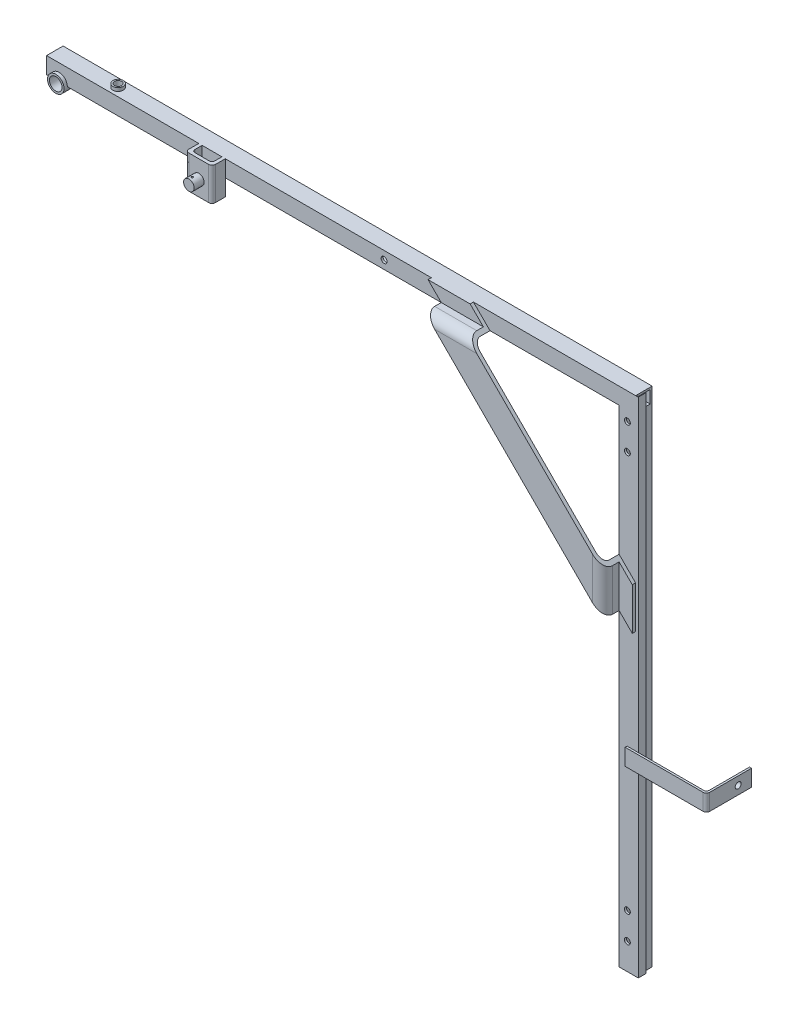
from build123d import *

# Parameters (mm, degrees)
ESQUISSE2_W              = 25
ESQUISSE2_H              = 25
ESQUISSE2_W_2            = 19
ESQUISSE2_H_2            = 19
ESQUISSE3_W              = 25
ESQUISSE3_H              = 25
ESQUISSE3_W_2            = 19
ESQUISSE3_H_2            = 19
EXTRUSION1_DEPTH         = 735
ESQUISSE4_R              = 12.5
ENL_V_MAT_EXTRU_2_DEPTH  = 1163.532257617
EXTRUSION2_DEPTH         = 5
EXTRUSION2_DEPTH_BACK    = 30
ESQUISSE5_R              = 12.5
ESQUISSE5_R_2            = 9.5
ESQUISSE7_R              = 4.5
ENL_V_MAT_EXTRU_4_DEPTH  = 1163.650527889
EXTRUSION3_DEPTH         = 30
ENL_V_MAT_EXTRU_5_DEPTH  = 25
CONG_1_R                 = 10
CONG_2_R                 = 10
ENL_V_MAT_EXTRU_6_DEPTH  = 415
ENL_V_MAT_EXTRU_7_DEPTH  = 1164.04019707
EXTRUSION5_DEPTH         = 50
ESQUISSE14_R             = 8
ENL_V_MAT_EXTRU_8_DEPTH  = 5
EXTRUSION6_DEPTH         = 15
EXTRUSION6_DEPTH_BACK    = 7
ESQUISSE15_R             = 8
ESQUISSE16_R             = 1.5
ENL_V_MAT_EXTRU_9_DEPTH  = 1172.305361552
ESQUISSE17_W             = 122.83893509
ESQUISSE17_H             = 25
EXTRUSION7_DEPTH         = 3
ESQUISSE18_W             = 3
ESQUISSE18_H             = 25
EXTRUSION8_DEPTH         = 65
CONG_3_R                 = 4
CONG_4_R                 = 5
ESQUISSE19_R             = 7.5
ENL_V_MAT_EXTRU_10_DEPTH = 65
EXTRUSION9_DEPTH         = 5
EXTRUSION9_DEPTH_BACK    = 3
ESQUISSE23_R             = 7.5
ESQUISSE23_R_2           = 4.5
EXTRUSION11_DEPTH        = 760
ESQUISSE26_R             = 7.802651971
EXTRUSION12_DEPTH        = 5
ESQUISSE27_R             = 5.5
ENL_V_MAT_EXTRU_11_DEPTH = 1175.768594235


with BuildPart() as part:
    # Balayage2: sweep along a path in Esquisse1
    with BuildLine(Plane.XY) as balayage2_path:
        Line((-890, 0), (0, 0))
    # Esquisse2 → Balayage2 (sweep)
    with BuildSketch(Plane(origin=(-890, 0, 0), x_dir=(0, 0, -1), z_dir=(1, 0, 0))):
        Rectangle(ESQUISSE2_W, ESQUISSE2_H)
        Rectangle(ESQUISSE2_W_2, ESQUISSE2_H_2, mode=Mode.SUBTRACT)
    sweep(path=balayage2_path.line)

    # Esquisse3 → Extrusion1 (add)
    with BuildSketch(Plane.XZ.offset(12.5)):
        with Locations((-12.5, 0)):
            Rectangle(ESQUISSE3_W, ESQUISSE3_H)
        with Locations((-12.5, 0)):
            Rectangle(ESQUISSE3_W_2, ESQUISSE3_H_2, mode=Mode.SUBTRACT)
    extrude(amount=EXTRUSION1_DEPTH)

    # Esquisse4 → Enl_v. mat.-Extru.2 (cut, through all)
    with BuildSketch(Plane.XY.offset(12.5)):
        with Locations((-871.107379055, -12.5)):
            Circle(ESQUISSE4_R)
    extrude(amount=-ENL_V_MAT_EXTRU_2_DEPTH, mode=Mode.SUBTRACT)

    # Esquisse5 → Extrusion2 (add, two sides: drawn at the far end of the back side and taken through both)
    with BuildSketch(Plane.XY.offset(12.5).offset(-EXTRUSION2_DEPTH_BACK)):
        with Locations((-871.107379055, -12.5)):
            Circle(ESQUISSE5_R)
        with Locations((-871.107379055, -12.5)):
            Circle(ESQUISSE5_R_2, mode=Mode.SUBTRACT)
    extrude(amount=EXTRUSION2_DEPTH + EXTRUSION2_DEPTH_BACK)

    # Esquisse7 → Enl_v. mat.-Extru.4 (cut, through all)
    with BuildSketch(Plane.XY.offset(12.5)):
        with Locations((-12.5, -27.5)):
            Circle(ESQUISSE7_R)
        with Locations((-12.5, -67.5)):
            Circle(ESQUISSE7_R)
        with Locations((-12.5, -707.5)):
            Circle(ESQUISSE7_R)
        with Locations((-12.5, -667.5)):
            Circle(ESQUISSE7_R)
        with Locations((-380, 0)):
            Circle(ESQUISSE7_R)
    extrude(amount=-ENL_V_MAT_EXTRU_4_DEPTH, mode=Mode.SUBTRACT)

    # Esquisse8 → Extrusion3 (add)
    with BuildSketch(Plane.XY.offset(12.5)):
        Polygon((-308.639610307, 12.5), (0, -296.139610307), (0, -232.5), (-245, 12.5), align=None)
    extrude(amount=EXTRUSION3_DEPTH)

    # Esquisse9 → Enl_v. mat.-Extru.5 (cut)
    with BuildSketch(Plane(origin=(0, 0, 12.5), x_dir=(-1, 0, 0), z_dir=(0, 0, -1))):
        Polygon((25, -271.139610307), (25, -207.5), (220, -12.5), (283.639610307, -12.5), align=None)
    extrude(amount=-ENL_V_MAT_EXTRU_5_DEPTH, mode=Mode.SUBTRACT)

    # Cong_1
    cong_1_edges = [part.edges().sort_by_distance(p)[0] for p in [
        (-251.819805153, -12.5, 37.5),
    ]]
    fillet(cong_1_edges, radius=CONG_1_R)

    # Cong_2
    cong_2_edges = [part.edges().sort_by_distance(p)[0] for p in [
        (-25, -239.319805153, 37.5),
    ]]
    fillet(cong_2_edges, radius=CONG_2_R)

    # Esquisse10 → Enl_v. mat.-Extru.6 (cut)
    with BuildSketch(Plane(origin=(0, 0, 0), x_dir=(0, 0, -1), z_dir=(1, 0, 0))):
        with BuildLine():
            Line((-17.5, 22.473904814), (-51.624786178, 20.979320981))
            Line((-51.624786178, 20.979320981), (-42.5, -22.5))
            ThreePointArc((-42.5, -22.5), (-38.106601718, -11.893398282), (-27.5, -7.5))
            Line((-27.5, -7.5), (-17.5, -7.5))
            Line((-17.5, -7.5), (-17.5, 22.473904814))
        make_face()
    extrude(amount=-ENL_V_MAT_EXTRU_6_DEPTH, mode=Mode.SUBTRACT)

    # Esquisse11 → Enl_v. mat.-Extru.7 (cut, through all)
    with BuildSketch(Plane(origin=(0, 0, 0), x_dir=(1, 0, 0), z_dir=(0, 1, 0))):
        with BuildLine():
            Line((-35.456388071, -42.49305539), (-35.456388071, -53.093557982))
            Line((-35.456388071, -53.093557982), (15.625768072, -53.093557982))
            Line((15.625768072, -53.093557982), (15.625768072, -17.5))
            Line((15.625768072, -17.5), (-20, -17.5))
            Line((-20, -17.5), (-20, -27.5))
            ThreePointArc((-20, -27.5), (-24.556002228, -38.266750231), (-35.456388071, -42.49305539))
        make_face()
    extrude(amount=-ENL_V_MAT_EXTRU_7_DEPTH, mode=Mode.SUBTRACT)

    # Esquisse13 → Extrusion5 (add)
    with BuildSketch(Plane(origin=(0, 12.5, 0), x_dir=(-1, 0, 0), z_dir=(0, 1, 0))):
        with BuildLine():
            Line((660, 12.5), (660, 27.5))
            ThreePointArc((660, 27.5), (658.535533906, 31.035533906), (655, 32.5))
            Line((655, 32.5), (625, 32.5))
            ThreePointArc((625, 32.5), (621.464466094, 31.035533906), (620, 27.5))
            Line((620, 27.5), (620, 12.5))
            Line((620, 12.5), (625, 12.5))
            Line((625, 12.5), (625, 23.5))
            ThreePointArc((625, 23.5), (626.171572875, 26.328427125), (629, 27.5))
            Line((629, 27.5), (651, 27.5))
            ThreePointArc((651, 27.5), (653.828427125, 26.328427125), (655, 23.5))
            Line((655, 23.5), (655, 12.5))
            Line((655, 12.5), (660, 12.5))
        make_face()
    extrude(amount=-EXTRUSION5_DEPTH)

    # Esquisse14 → Enl_v. mat.-Extru.8 (cut)
    with BuildSketch(Plane.XY.offset(32.5)):
        with Locations((-640, -14.5)):
            Circle(ESQUISSE14_R)
    extrude(amount=-ENL_V_MAT_EXTRU_8_DEPTH, mode=Mode.SUBTRACT)

    # Esquisse15 → Extrusion6 (add, two sides: drawn at the far end of the back side and taken through both)
    with BuildSketch(Plane.XY.offset(32.5).offset(-EXTRUSION6_DEPTH_BACK)):
        with Locations((-640, -14.5)):
            Circle(ESQUISSE15_R)
    extrude(amount=EXTRUSION6_DEPTH + EXTRUSION6_DEPTH_BACK)

    # Esquisse16 → Enl_v. mat.-Extru.9 (cut, through all)
    with BuildSketch(Plane(origin=(0, 12.5, 0), x_dir=(-1, 0, 0), z_dir=(0, 1, 0))):
        with Locations(Location((640, 42.5, 0), (0, 0, 90))):
            Circle(ESQUISSE16_R)
    extrude(amount=-ENL_V_MAT_EXTRU_9_DEPTH, mode=Mode.SUBTRACT)

    # Esquisse17 → Extrusion7 (add)
    with BuildSketch(Plane.XY.offset(12.5)):
        with Locations((48.580532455, -465)):
            Rectangle(ESQUISSE17_W, ESQUISSE17_H)
    extrude(amount=EXTRUSION7_DEPTH)

    # Esquisse18 → Extrusion8 (add)
    with BuildSketch(Plane(origin=(0, 0, 12.5), x_dir=(-1, 0, 0), z_dir=(0, 0, -1))):
        with Locations((-108.5, -465)):
            Rectangle(ESQUISSE18_W, ESQUISSE18_H)
    extrude(amount=EXTRUSION8_DEPTH)

    # Cong_3
    cong_3_edges = [part.edges().sort_by_distance(p)[0] for p in [
        (107, -465, 12.5),
    ]]
    fillet(cong_3_edges, radius=CONG_3_R)

    # Cong_4
    cong_4_edges = [part.edges().sort_by_distance(p)[0] for p in [
        (110, -465, 15.5),
    ]]
    fillet(cong_4_edges, radius=CONG_4_R)

    # Esquisse19 → Enl_v. mat.-Extru.10 (cut)
    with BuildSketch(Plane.ZY.offset(-107)):
        with Locations((-32.5, -465)):
            Circle(ESQUISSE19_R)
    extrude(amount=-ENL_V_MAT_EXTRU_10_DEPTH, mode=Mode.SUBTRACT)

    # Esquisse23 → Extrusion9 (add, two sides: drawn at the far end of the back side and taken through both)
    with BuildSketch(Plane.ZY.offset(-107).offset(-EXTRUSION9_DEPTH_BACK)):
        with Locations((-32.5, -465)):
            Circle(ESQUISSE23_R)
        with Locations((-32.5, -465)):
            Circle(ESQUISSE23_R_2, mode=Mode.SUBTRACT)
    extrude(amount=EXTRUSION9_DEPTH + EXTRUSION9_DEPTH_BACK)

    # Esquisse25 → Extrusion11 (add)
    with BuildSketch(Plane.XZ.offset(747.5)):
        Polygon((0, 12.5), (4, 12.5), (4, 0.5), (3, 0.5), (3, 11.5), (0, 11.5), align=None)
    extrude(amount=-EXTRUSION11_DEPTH)

    # Esquisse26 → Extrusion12 (add)
    with BuildSketch(Plane(origin=(0, 12.5, 0), x_dir=(-1, 0, 0), z_dir=(0, 1, 0))):
        with Locations(Location((794.47211894, 0, 0), (0, 0, 270))):
            Circle(ESQUISSE26_R)
    extrude(amount=EXTRUSION12_DEPTH)

    # Esquisse27 → Enl_v. mat.-Extru.11 (cut, through all)
    with BuildSketch(Plane(origin=(0, 17.5, 0), x_dir=(-1, 0, 0), z_dir=(0, 1, 0))):
        with Locations(Location((794.47211894, 0, 0), (0, 0, 90))):
            Circle(ESQUISSE27_R)
    extrude(amount=-ENL_V_MAT_EXTRU_11_DEPTH, mode=Mode.SUBTRACT)


solid = part.part
